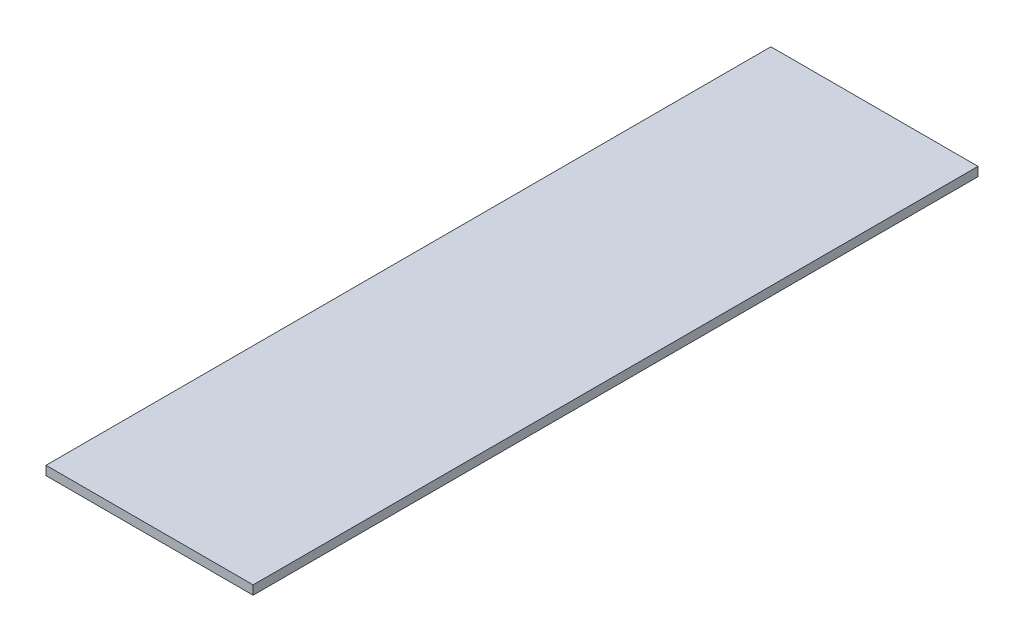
ISO-10303-21;
HEADER;
FILE_DESCRIPTION(('STEP AP214'),'2;1');
FILE_NAME('part.step','',(''),(''),'','','');
FILE_SCHEMA(('AUTOMOTIVE_DESIGN { 1 0 10303 214 1 1 1 1 }'));
ENDSEC;
DATA;
#1=APPLICATION_CONTEXT('core data for automotive mechanical design processes');
#2=APPLICATION_PROTOCOL_DEFINITION('international standard','automotive_design',2000,#1);
#3=PRODUCT_CONTEXT('',#1,'mechanical');
#4=PRODUCT('Part','Part','',(#3));
#5=PRODUCT_RELATED_PRODUCT_CATEGORY('part','',(#4));
#6=PRODUCT_DEFINITION_FORMATION('','',#4);
#7=PRODUCT_DEFINITION_CONTEXT('part definition',#1,'design');
#8=PRODUCT_DEFINITION('design','',#6,#7);
#9=PRODUCT_DEFINITION_SHAPE('','',#8);
#10=(LENGTH_UNIT() NAMED_UNIT(*) SI_UNIT(.MILLI.,.METRE.));
#11=(NAMED_UNIT(*) PLANE_ANGLE_UNIT() SI_UNIT($,.RADIAN.));
#12=(NAMED_UNIT(*) SI_UNIT($,.STERADIAN.) SOLID_ANGLE_UNIT());
#13=UNCERTAINTY_MEASURE_WITH_UNIT(LENGTH_MEASURE(1.E-05),#10,'distance_accuracy_value','');
#14=(GEOMETRIC_REPRESENTATION_CONTEXT(3) GLOBAL_UNCERTAINTY_ASSIGNED_CONTEXT((#13)) GLOBAL_UNIT_ASSIGNED_CONTEXT((#10,
#11,#12)) REPRESENTATION_CONTEXT('',''));
#15=CARTESIAN_POINT('',(0.,0.,0.));
#16=DIRECTION('',(0.,0.,1.));
#17=DIRECTION('',(1.,0.,0.));
#18=AXIS2_PLACEMENT_3D('',#15,#16,#17);
#19=CARTESIAN_POINT('',(0.,1.,-80.5));
#20=DIRECTION('',(0.,0.,-1.));
#21=DIRECTION('',(-1.,0.,0.));
#22=AXIS2_PLACEMENT_3D('',#19,#20,#21);
#23=PLANE('',#22);
#24=DIRECTION('',(1.,0.,0.));
#25=VECTOR('',#24,1.);
#26=CARTESIAN_POINT('',(0.,0.,-80.5));
#27=LINE('',#26,#25);
#28=CARTESIAN_POINT('',(0.,0.,-80.5));
#29=VERTEX_POINT('',#28);
#30=CARTESIAN_POINT('',(23.,0.,-80.5));
#31=VERTEX_POINT('',#30);
#32=EDGE_CURVE('E97',#29,#31,#27,.T.);
#33=ORIENTED_EDGE('',*,*,#32,.F.);
#34=DIRECTION('',(0.,-1.,0.));
#35=VECTOR('',#34,1.);
#36=CARTESIAN_POINT('',(0.,1.,-80.5));
#37=LINE('',#36,#35);
#38=CARTESIAN_POINT('',(0.,1.,-80.5));
#39=VERTEX_POINT('',#38);
#40=EDGE_CURVE('E11',#39,#29,#37,.T.);
#41=ORIENTED_EDGE('',*,*,#40,.F.);
#42=DIRECTION('',(1.,0.,0.));
#43=VECTOR('',#42,1.);
#44=CARTESIAN_POINT('',(0.,1.,-80.5));
#45=LINE('',#44,#43);
#46=CARTESIAN_POINT('',(23.,1.,-80.5));
#47=VERTEX_POINT('',#46);
#48=EDGE_CURVE('E91',#39,#47,#45,.T.);
#49=ORIENTED_EDGE('',*,*,#48,.T.);
#50=DIRECTION('',(0.,-1.,0.));
#51=VECTOR('',#50,1.);
#52=CARTESIAN_POINT('',(23.,1.,-80.5));
#53=LINE('',#52,#51);
#54=EDGE_CURVE('E72',#47,#31,#53,.T.);
#55=ORIENTED_EDGE('',*,*,#54,.T.);
#56=EDGE_LOOP('',(#33,#41,#49,#55));
#57=FACE_BOUND('',#56,.T.);
#58=ADVANCED_FACE('F34',(#57),#23,.T.);
#59=CARTESIAN_POINT('',(0.,1.,0.));
#60=DIRECTION('',(-1.,0.,0.));
#61=DIRECTION('',(0.,0.,1.));
#62=AXIS2_PLACEMENT_3D('',#59,#60,#61);
#63=PLANE('',#62);
#64=DIRECTION('',(0.,0.,-1.));
#65=VECTOR('',#64,1.);
#66=CARTESIAN_POINT('',(0.,0.,0.));
#67=LINE('',#66,#65);
#68=CARTESIAN_POINT('',(0.,0.,0.));
#69=VERTEX_POINT('',#68);
#70=EDGE_CURVE('E85',#69,#29,#67,.T.);
#71=ORIENTED_EDGE('',*,*,#70,.F.);
#72=DIRECTION('',(0.,-1.,0.));
#73=VECTOR('',#72,1.);
#74=CARTESIAN_POINT('',(0.,1.,0.));
#75=LINE('',#74,#73);
#76=CARTESIAN_POINT('',(0.,1.,0.));
#77=VERTEX_POINT('',#76);
#78=EDGE_CURVE('E42',#77,#69,#75,.T.);
#79=ORIENTED_EDGE('',*,*,#78,.F.);
#80=DIRECTION('',(0.,0.,-1.));
#81=VECTOR('',#80,1.);
#82=CARTESIAN_POINT('',(0.,1.,0.));
#83=LINE('',#82,#81);
#84=EDGE_CURVE('E83',#77,#39,#83,.T.);
#85=ORIENTED_EDGE('',*,*,#84,.T.);
#86=ORIENTED_EDGE('',*,*,#40,.T.);
#87=EDGE_LOOP('',(#71,#79,#85,#86));
#88=FACE_BOUND('',#87,.T.);
#89=ADVANCED_FACE('F81',(#88),#63,.T.);
#90=CARTESIAN_POINT('',(0.,1.,0.));
#91=DIRECTION('',(0.,0.,-1.));
#92=DIRECTION('',(-1.,0.,0.));
#93=AXIS2_PLACEMENT_3D('',#90,#91,#92);
#94=PLANE('',#93);
#95=DIRECTION('',(1.,0.,0.));
#96=VECTOR('',#95,1.);
#97=CARTESIAN_POINT('',(0.,0.,0.));
#98=LINE('',#97,#96);
#99=CARTESIAN_POINT('',(23.,0.,0.));
#100=VERTEX_POINT('',#99);
#101=EDGE_CURVE('E65',#69,#100,#98,.T.);
#102=ORIENTED_EDGE('',*,*,#101,.T.);
#103=DIRECTION('',(0.,-1.,0.));
#104=VECTOR('',#103,1.);
#105=CARTESIAN_POINT('',(23.,1.,0.));
#106=LINE('',#105,#104);
#107=CARTESIAN_POINT('',(23.,1.,0.));
#108=VERTEX_POINT('',#107);
#109=EDGE_CURVE('E86',#108,#100,#106,.T.);
#110=ORIENTED_EDGE('',*,*,#109,.F.);
#111=DIRECTION('',(1.,0.,0.));
#112=VECTOR('',#111,1.);
#113=CARTESIAN_POINT('',(0.,1.,0.));
#114=LINE('',#113,#112);
#115=EDGE_CURVE('E87',#77,#108,#114,.T.);
#116=ORIENTED_EDGE('',*,*,#115,.F.);
#117=ORIENTED_EDGE('',*,*,#78,.T.);
#118=EDGE_LOOP('',(#102,#110,#116,#117));
#119=FACE_BOUND('',#118,.T.);
#120=ADVANCED_FACE('F88',(#119),#94,.F.);
#121=CARTESIAN_POINT('',(23.,1.,0.));
#122=DIRECTION('',(-1.,0.,0.));
#123=DIRECTION('',(0.,0.,1.));
#124=AXIS2_PLACEMENT_3D('',#121,#122,#123);
#125=PLANE('',#124);
#126=DIRECTION('',(0.,0.,-1.));
#127=VECTOR('',#126,1.);
#128=CARTESIAN_POINT('',(23.,0.,0.));
#129=LINE('',#128,#127);
#130=EDGE_CURVE('E93',#100,#31,#129,.T.);
#131=ORIENTED_EDGE('',*,*,#130,.T.);
#132=ORIENTED_EDGE('',*,*,#54,.F.);
#133=DIRECTION('',(0.,0.,-1.));
#134=VECTOR('',#133,1.);
#135=CARTESIAN_POINT('',(23.,1.,0.));
#136=LINE('',#135,#134);
#137=EDGE_CURVE('E50',#108,#47,#136,.T.);
#138=ORIENTED_EDGE('',*,*,#137,.F.);
#139=ORIENTED_EDGE('',*,*,#109,.T.);
#140=EDGE_LOOP('',(#131,#132,#138,#139));
#141=FACE_BOUND('',#140,.T.);
#142=ADVANCED_FACE('F106',(#141),#125,.F.);
#143=CARTESIAN_POINT('',(0.,1.,0.));
#144=DIRECTION('',(0.,1.,0.));
#145=DIRECTION('',(0.,0.,1.));
#146=AXIS2_PLACEMENT_3D('',#143,#144,#145);
#147=PLANE('',#146);
#148=ORIENTED_EDGE('',*,*,#48,.F.);
#149=ORIENTED_EDGE('',*,*,#84,.F.);
#150=ORIENTED_EDGE('',*,*,#115,.T.);
#151=ORIENTED_EDGE('',*,*,#137,.T.);
#152=EDGE_LOOP('',(#148,#149,#150,#151));
#153=FACE_BOUND('',#152,.T.);
#154=ADVANCED_FACE('F90',(#153),#147,.T.);
#155=CARTESIAN_POINT('',(0.,0.,0.));
#156=DIRECTION('',(0.,1.,0.));
#157=DIRECTION('',(0.,0.,1.));
#158=AXIS2_PLACEMENT_3D('',#155,#156,#157);
#159=PLANE('',#158);
#160=ORIENTED_EDGE('',*,*,#32,.T.);
#161=ORIENTED_EDGE('',*,*,#130,.F.);
#162=ORIENTED_EDGE('',*,*,#101,.F.);
#163=ORIENTED_EDGE('',*,*,#70,.T.);
#164=EDGE_LOOP('',(#160,#161,#162,#163));
#165=FACE_BOUND('',#164,.T.);
#166=ADVANCED_FACE('F108',(#165),#159,.F.);
#167=CLOSED_SHELL('',(#58,#89,#120,#142,#154,#166));
#168=MANIFOLD_SOLID_BREP('B2',#167);
#169=ADVANCED_BREP_SHAPE_REPRESENTATION('',(#18,#168),#14);
#170=SHAPE_DEFINITION_REPRESENTATION(#9,#169);
ENDSEC;
END-ISO-10303-21;
